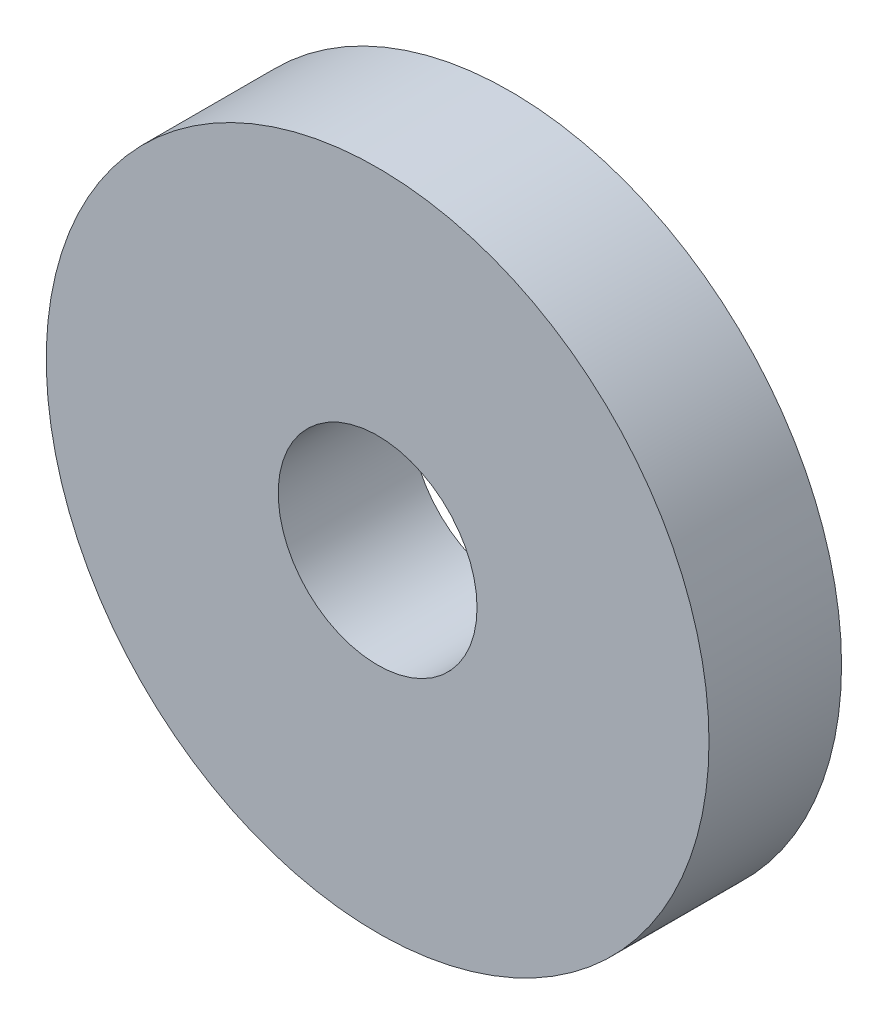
from build123d import *

# Parameters (mm, degrees)
ESQUISSE1_R      = 25
ESQUISSE1_R_2    = 7.5
EXTRUSION1_DEPTH = 10


with BuildPart() as part:
    # Esquisse1 → Extrusion1 (new body)
    with BuildSketch(Plane.XY):
        Circle(ESQUISSE1_R)
        Circle(ESQUISSE1_R_2, mode=Mode.SUBTRACT)
    extrude(amount=EXTRUSION1_DEPTH)


solid = part.part
